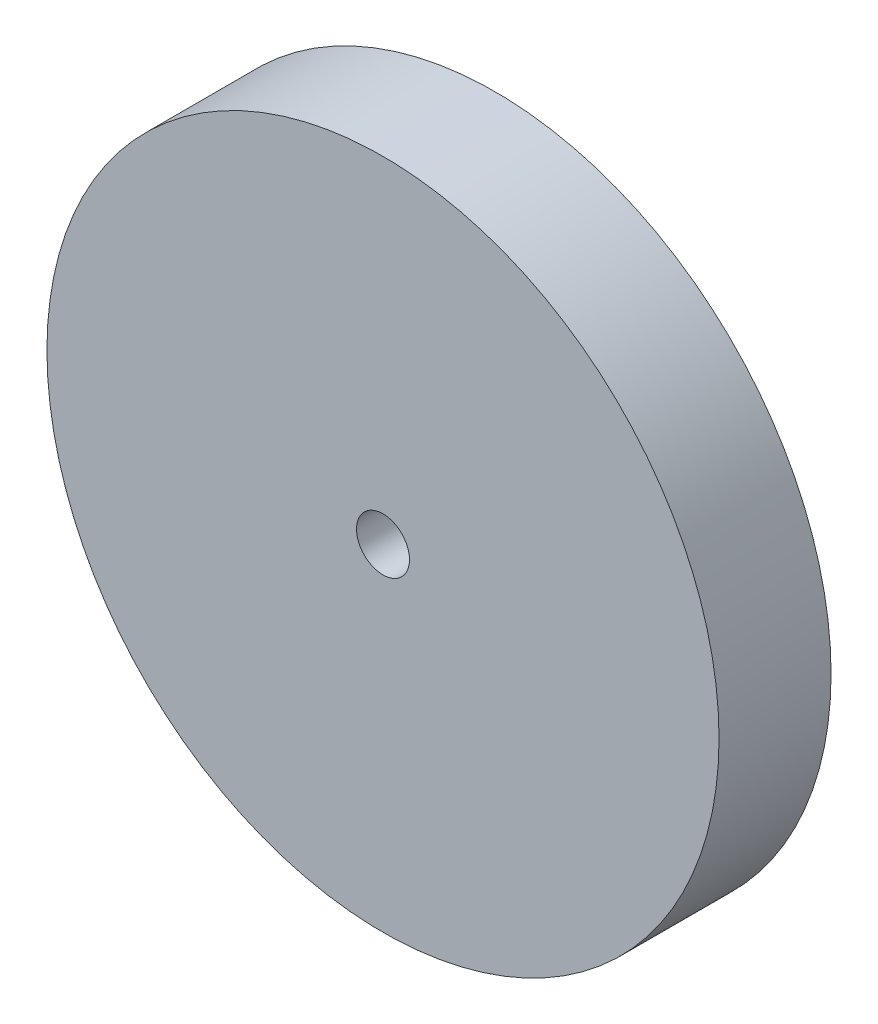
ISO-10303-21;
HEADER;
FILE_DESCRIPTION(('STEP AP214'),'2;1');
FILE_NAME('part.step','',(''),(''),'','','');
FILE_SCHEMA(('AUTOMOTIVE_DESIGN { 1 0 10303 214 1 1 1 1 }'));
ENDSEC;
DATA;
#1=APPLICATION_CONTEXT('core data for automotive mechanical design processes');
#2=APPLICATION_PROTOCOL_DEFINITION('international standard','automotive_design',2000,#1);
#3=PRODUCT_CONTEXT('',#1,'mechanical');
#4=PRODUCT('Part','Part','',(#3));
#5=PRODUCT_RELATED_PRODUCT_CATEGORY('part','',(#4));
#6=PRODUCT_DEFINITION_FORMATION('','',#4);
#7=PRODUCT_DEFINITION_CONTEXT('part definition',#1,'design');
#8=PRODUCT_DEFINITION('design','',#6,#7);
#9=PRODUCT_DEFINITION_SHAPE('','',#8);
#10=(LENGTH_UNIT() NAMED_UNIT(*) SI_UNIT(.MILLI.,.METRE.));
#11=(NAMED_UNIT(*) PLANE_ANGLE_UNIT() SI_UNIT($,.RADIAN.));
#12=(NAMED_UNIT(*) SI_UNIT($,.STERADIAN.) SOLID_ANGLE_UNIT());
#13=UNCERTAINTY_MEASURE_WITH_UNIT(LENGTH_MEASURE(1.E-05),#10,'distance_accuracy_value','');
#14=(GEOMETRIC_REPRESENTATION_CONTEXT(3) GLOBAL_UNCERTAINTY_ASSIGNED_CONTEXT((#13)) GLOBAL_UNIT_ASSIGNED_CONTEXT((#10,
#11,#12)) REPRESENTATION_CONTEXT('',''));
#15=CARTESIAN_POINT('',(0.,0.,0.));
#16=DIRECTION('',(0.,0.,1.));
#17=DIRECTION('',(1.,0.,0.));
#18=AXIS2_PLACEMENT_3D('',#15,#16,#17);
#19=CARTESIAN_POINT('',(0.,0.,12.7));
#20=DIRECTION('',(0.,0.,1.));
#21=DIRECTION('',(1.,0.,0.));
#22=AXIS2_PLACEMENT_3D('',#19,#20,#21);
#23=PLANE('',#22);
#24=CARTESIAN_POINT('',(0.,0.,12.7));
#25=DIRECTION('',(0.,0.,1.));
#26=DIRECTION('',(1.,0.,0.));
#27=AXIS2_PLACEMENT_3D('',#24,#25,#26);
#28=CIRCLE('',#27,38.1);
#29=CARTESIAN_POINT('',(38.1,0.,12.7));
#30=VERTEX_POINT('',#29);
#31=EDGE_CURVE('E10',#30,#30,#28,.T.);
#32=ORIENTED_EDGE('',*,*,#31,.T.);
#33=EDGE_LOOP('',(#32));
#34=FACE_BOUND('',#33,.T.);
#35=CARTESIAN_POINT('',(0.,0.,12.7));
#36=DIRECTION('',(0.,0.,1.));
#37=DIRECTION('',(1.,0.,0.));
#38=AXIS2_PLACEMENT_3D('',#35,#36,#37);
#39=CIRCLE('',#38,3.);
#40=CARTESIAN_POINT('',(3.,0.,12.7));
#41=VERTEX_POINT('',#40);
#42=EDGE_CURVE('E48',#41,#41,#39,.T.);
#43=ORIENTED_EDGE('',*,*,#42,.F.);
#44=EDGE_LOOP('',(#43));
#45=FACE_BOUND('',#44,.T.);
#46=ADVANCED_FACE('F37',(#34,#45),#23,.T.);
#47=CARTESIAN_POINT('',(0.,0.,0.));
#48=DIRECTION('',(0.,0.,1.));
#49=DIRECTION('',(1.,0.,0.));
#50=AXIS2_PLACEMENT_3D('',#47,#48,#49);
#51=PLANE('',#50);
#52=CARTESIAN_POINT('',(0.,0.,0.));
#53=DIRECTION('',(0.,0.,1.));
#54=DIRECTION('',(1.,0.,0.));
#55=AXIS2_PLACEMENT_3D('',#52,#53,#54);
#56=CIRCLE('',#55,38.1);
#57=CARTESIAN_POINT('',(38.1,0.,0.));
#58=VERTEX_POINT('',#57);
#59=EDGE_CURVE('E41',#58,#58,#56,.T.);
#60=ORIENTED_EDGE('',*,*,#59,.F.);
#61=EDGE_LOOP('',(#60));
#62=FACE_BOUND('',#61,.T.);
#63=CARTESIAN_POINT('',(0.,0.,0.));
#64=DIRECTION('',(0.,0.,1.));
#65=DIRECTION('',(1.,0.,0.));
#66=AXIS2_PLACEMENT_3D('',#63,#64,#65);
#67=CIRCLE('',#66,3.);
#68=CARTESIAN_POINT('',(3.,0.,0.));
#69=VERTEX_POINT('',#68);
#70=EDGE_CURVE('E50',#69,#69,#67,.T.);
#71=ORIENTED_EDGE('',*,*,#70,.T.);
#72=EDGE_LOOP('',(#71));
#73=FACE_BOUND('',#72,.T.);
#74=ADVANCED_FACE('F60',(#62,#73),#51,.F.);
#75=CARTESIAN_POINT('',(0.,0.,12.7));
#76=DIRECTION('',(0.,0.,-1.));
#77=DIRECTION('',(-1.,0.,0.));
#78=AXIS2_PLACEMENT_3D('',#75,#76,#77);
#79=CYLINDRICAL_SURFACE('',#78,38.1);
#80=ORIENTED_EDGE('',*,*,#31,.F.);
#81=EDGE_LOOP('',(#80));
#82=FACE_BOUND('',#81,.T.);
#83=ORIENTED_EDGE('',*,*,#59,.T.);
#84=EDGE_LOOP('',(#83));
#85=FACE_BOUND('',#84,.T.);
#86=ADVANCED_FACE('F39',(#82,#85),#79,.T.);
#87=CARTESIAN_POINT('',(0.,0.,12.7));
#88=DIRECTION('',(0.,0.,-1.));
#89=DIRECTION('',(-1.,0.,0.));
#90=AXIS2_PLACEMENT_3D('',#87,#88,#89);
#91=CYLINDRICAL_SURFACE('',#90,3.);
#92=ORIENTED_EDGE('',*,*,#42,.T.);
#93=EDGE_LOOP('',(#92));
#94=FACE_BOUND('',#93,.T.);
#95=ORIENTED_EDGE('',*,*,#70,.F.);
#96=EDGE_LOOP('',(#95));
#97=FACE_BOUND('',#96,.T.);
#98=ADVANCED_FACE('F56',(#94,#97),#91,.F.);
#99=CLOSED_SHELL('',(#46,#74,#86,#98));
#100=MANIFOLD_SOLID_BREP('B2',#99);
#101=ADVANCED_BREP_SHAPE_REPRESENTATION('',(#18,#100),#14);
#102=SHAPE_DEFINITION_REPRESENTATION(#9,#101);
ENDSEC;
END-ISO-10303-21;
